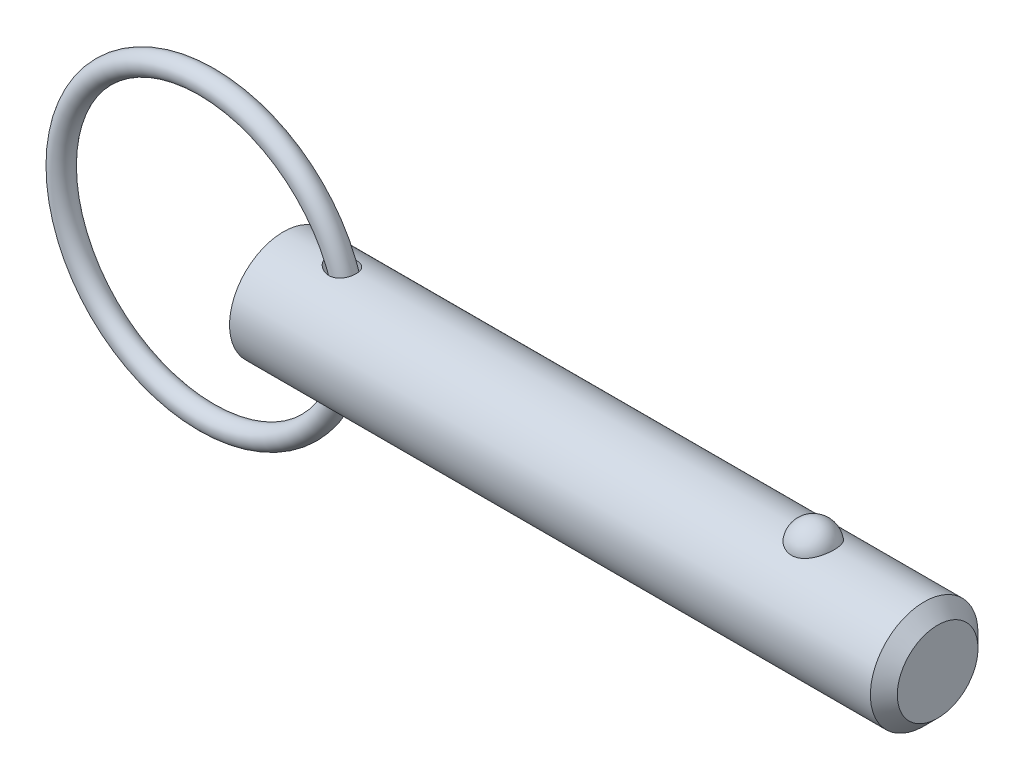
ISO-10303-21;
HEADER;
FILE_DESCRIPTION(('STEP AP214'),'2;1');
FILE_NAME('part.step','',(''),(''),'','','');
FILE_SCHEMA(('AUTOMOTIVE_DESIGN { 1 0 10303 214 1 1 1 1 }'));
ENDSEC;
DATA;
#1=APPLICATION_CONTEXT('core data for automotive mechanical design processes');
#2=APPLICATION_PROTOCOL_DEFINITION('international standard','automotive_design',2000,#1);
#3=PRODUCT_CONTEXT('',#1,'mechanical');
#4=PRODUCT('Part','Part','',(#3));
#5=PRODUCT_RELATED_PRODUCT_CATEGORY('part','',(#4));
#6=PRODUCT_DEFINITION_FORMATION('','',#4);
#7=PRODUCT_DEFINITION_CONTEXT('part definition',#1,'design');
#8=PRODUCT_DEFINITION('design','',#6,#7);
#9=PRODUCT_DEFINITION_SHAPE('','',#8);
#10=(LENGTH_UNIT() NAMED_UNIT(*) SI_UNIT(.MILLI.,.METRE.));
#11=(NAMED_UNIT(*) PLANE_ANGLE_UNIT() SI_UNIT($,.RADIAN.));
#12=(NAMED_UNIT(*) SI_UNIT($,.STERADIAN.) SOLID_ANGLE_UNIT());
#13=UNCERTAINTY_MEASURE_WITH_UNIT(LENGTH_MEASURE(1.E-05),#10,'distance_accuracy_value','');
#14=(GEOMETRIC_REPRESENTATION_CONTEXT(3) GLOBAL_UNCERTAINTY_ASSIGNED_CONTEXT((#13)) GLOBAL_UNIT_ASSIGNED_CONTEXT((#10,
#11,#12)) REPRESENTATION_CONTEXT('',''));
#15=CARTESIAN_POINT('',(0.,0.,0.));
#16=DIRECTION('',(0.,0.,1.));
#17=DIRECTION('',(1.,0.,0.));
#18=AXIS2_PLACEMENT_3D('',#15,#16,#17);
#19=CARTESIAN_POINT('',(-6.70471658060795,0.,0.));
#20=DIRECTION('',(0.,0.,1.));
#21=DIRECTION('',(1.,0.,0.));
#22=AXIS2_PLACEMENT_3D('',#19,#20,#21);
#23=TOROIDAL_SURFACE('',#22,12.7,0.940000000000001);
#24=CARTESIAN_POINT('',(6.93528341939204,0.,0.));
#25=VERTEX_POINT('',#24);
#26=VERTEX_LOOP('',#25);
#27=FACE_BOUND('',#26,.T.);
#28=ADVANCED_FACE('P0_F12',(#27),#23,.T.);
#29=CLOSED_SHELL('',(#28));
#30=MANIFOLD_SOLID_BREP('P0_B1',#29);
#31=CARTESIAN_POINT('',(0.,0.,0.));
#32=DIRECTION('',(1.,0.,0.));
#33=DIRECTION('',(0.,0.,-1.));
#34=AXIS2_PLACEMENT_3D('',#31,#32,#33);
#35=CYLINDRICAL_SURFACE('',#34,4.7);
#36=CARTESIAN_POINT('',(4.16378072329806,4.63584137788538,-0.773934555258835));
#37=CARTESIAN_POINT('',(4.22041228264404,4.62659903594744,-0.829297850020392));
#38=CARTESIAN_POINT('',(4.28206987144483,4.61719767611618,-0.87952289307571));
#39=CARTESIAN_POINT('',(4.41303152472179,4.59925351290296,-0.968997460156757));
#40=CARTESIAN_POINT('',(4.4823442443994,4.59071170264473,-1.00823437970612));
#41=CARTESIAN_POINT('',(4.626507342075,4.5755493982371,-1.07495006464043));
#42=CARTESIAN_POINT('',(4.70135029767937,4.56892638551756,-1.10244426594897));
#43=CARTESIAN_POINT('',(4.85470490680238,4.55848940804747,-1.14483874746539));
#44=CARTESIAN_POINT('',(4.93321503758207,4.55467428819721,-1.15974420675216));
#45=CARTESIAN_POINT('',(5.09197970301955,4.55051176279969,-1.17597559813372));
#46=CARTESIAN_POINT('',(5.17223836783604,4.55017372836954,-1.17726483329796));
#47=CARTESIAN_POINT('',(5.33159446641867,4.55326696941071,-1.16524823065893));
#48=CARTESIAN_POINT('',(5.41069268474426,4.55669556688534,-1.15195276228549));
#49=CARTESIAN_POINT('',(5.55698758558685,4.56647801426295,-1.11249214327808));
#50=CARTESIAN_POINT('',(5.62458628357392,4.57250771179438,-1.08773548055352));
#51=CARTESIAN_POINT('',(5.75397700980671,4.58665356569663,-1.02644632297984));
#52=CARTESIAN_POINT('',(5.8157717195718,4.59476875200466,-0.989919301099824));
#53=CARTESIAN_POINT('',(5.92681484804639,4.61135052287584,-0.90939126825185));
#54=CARTESIAN_POINT('',(5.97666790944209,4.61973919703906,-0.866204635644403));
#55=CARTESIAN_POINT('',(6.06817854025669,4.63643253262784,-0.771868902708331));
#56=CARTESIAN_POINT('',(6.10983710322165,4.64473720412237,-0.720720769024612));
#57=CARTESIAN_POINT('',(6.18318089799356,4.660174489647,-0.612928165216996));
#58=CARTESIAN_POINT('',(6.21503150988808,4.66732544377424,-0.55639864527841));
#59=CARTESIAN_POINT('',(6.26900210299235,4.67985590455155,-0.438689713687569));
#60=CARTESIAN_POINT('',(6.29112194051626,4.68523538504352,-0.377510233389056));
#61=CARTESIAN_POINT('',(6.32523846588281,4.6936733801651,-0.251831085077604));
#62=CARTESIAN_POINT('',(6.33717189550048,4.69671737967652,-0.187313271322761));
#63=CARTESIAN_POINT('',(6.35042407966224,4.70010386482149,-0.0571258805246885));
#64=CARTESIAN_POINT('',(6.3517424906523,4.70044626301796,0.00854373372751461));
#65=CARTESIAN_POINT('',(6.34371729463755,4.69838816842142,0.139481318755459));
#66=CARTESIAN_POINT('',(6.33432596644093,4.69597539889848,0.204746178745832));
#67=CARTESIAN_POINT('',(6.30500866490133,4.68864655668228,0.332720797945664));
#68=CARTESIAN_POINT('',(6.28508259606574,4.68373046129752,0.395430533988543));
#69=CARTESIAN_POINT('',(6.23516511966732,4.67193431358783,0.516455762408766));
#70=CARTESIAN_POINT('',(6.2051812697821,4.66505573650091,0.574774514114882));
#71=CARTESIAN_POINT('',(6.13586314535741,4.65009270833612,0.685387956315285));
#72=CARTESIAN_POINT('',(6.09652950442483,4.64200833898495,0.737683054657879));
#73=CARTESIAN_POINT('',(6.00979078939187,4.62559001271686,0.834455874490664));
#74=CARTESIAN_POINT('',(5.96243625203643,4.61725787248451,0.878979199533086));
#75=CARTESIAN_POINT('',(5.86079843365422,4.60122574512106,0.959378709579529));
#76=CARTESIAN_POINT('',(5.80651591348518,4.59352568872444,0.995255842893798));
#77=CARTESIAN_POINT('',(5.69277386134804,4.57961669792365,1.05741527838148));
#78=CARTESIAN_POINT('',(5.63333134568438,4.57340309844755,1.08372773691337));
#79=CARTESIAN_POINT('',(5.51084249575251,4.56305640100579,1.12650026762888));
#80=CARTESIAN_POINT('',(5.44779577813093,4.55892352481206,1.14295928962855));
#81=CARTESIAN_POINT('',(5.3179566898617,4.55299444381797,1.1663590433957));
#82=CARTESIAN_POINT('',(5.25110869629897,4.55127026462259,1.17300670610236));
#83=CARTESIAN_POINT('',(5.11716812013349,4.55043953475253,1.17622268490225));
#84=CARTESIAN_POINT('',(5.05007546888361,4.55133378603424,1.17278791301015));
#85=CARTESIAN_POINT('',(4.91166083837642,4.55569951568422,1.15571913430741));
#86=CARTESIAN_POINT('',(4.84044690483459,4.55937764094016,1.1412666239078));
#87=CARTESIAN_POINT('',(4.70108819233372,4.56903562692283,1.10196123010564));
#88=CARTESIAN_POINT('',(4.63294574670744,4.57501720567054,1.07710058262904));
#89=CARTESIAN_POINT('',(4.49477300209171,4.58927184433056,1.01474439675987));
#90=CARTESIAN_POINT('',(4.42520748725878,4.59771156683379,0.976252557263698));
#91=CARTESIAN_POINT('',(4.29354165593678,4.61552030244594,0.888246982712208));
#92=CARTESIAN_POINT('',(4.2314393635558,4.62488906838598,0.838736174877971));
#93=CARTESIAN_POINT('',(4.1260966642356,4.64192969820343,0.738015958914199));
#94=CARTESIAN_POINT('',(4.08142630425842,4.64963595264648,0.68830869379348));
#95=CARTESIAN_POINT('',(4.00081170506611,4.66411457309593,0.582144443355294));
#96=CARTESIAN_POINT('',(3.96485623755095,4.6708881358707,0.525696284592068));
#97=CARTESIAN_POINT('',(3.9081839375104,4.68183565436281,0.415917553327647));
#98=CARTESIAN_POINT('',(3.88599581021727,4.68624644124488,0.363372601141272));
#99=CARTESIAN_POINT('',(3.85055971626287,4.693376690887,0.255230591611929));
#100=CARTESIAN_POINT('',(3.83730635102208,4.69609717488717,0.199635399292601));
#101=CARTESIAN_POINT('',(3.82058225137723,4.69954043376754,0.0867104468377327));
#102=CARTESIAN_POINT('',(3.81714632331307,4.70025610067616,0.0293752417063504));
#103=CARTESIAN_POINT('',(3.82041409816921,4.69957935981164,-0.0849928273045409));
#104=CARTESIAN_POINT('',(3.82711802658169,4.69818690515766,-0.14202568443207));
#105=CARTESIAN_POINT('',(3.84950128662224,4.69360426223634,-0.250744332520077));
#106=CARTESIAN_POINT('',(3.8646389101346,4.69052274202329,-0.302548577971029));
#107=CARTESIAN_POINT('',(3.90261190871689,4.68295207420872,-0.403121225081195));
#108=CARTESIAN_POINT('',(3.92544863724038,4.67846267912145,-0.451889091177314));
#109=CARTESIAN_POINT('',(3.9799930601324,4.6680441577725,-0.549522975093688));
#110=CARTESIAN_POINT('',(4.01228648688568,4.66202553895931,-0.598050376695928));
#111=CARTESIAN_POINT('',(4.08340845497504,4.64931397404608,-0.689954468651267));
#112=CARTESIAN_POINT('',(4.1222426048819,4.64262045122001,-0.733326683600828));
#113=CARTESIAN_POINT('',(4.16378072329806,4.63584137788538,-0.773934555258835));
#114=B_SPLINE_CURVE_WITH_KNOTS('',3,(#36,#37,#38,#39,#40,#41,#42,#43,#44,#45,#46,#47,#48,#49,
#50,#51,#52,#53,#54,#55,#56,#57,#58,#59,#60,#61,#62,#63,#64,#65,#66,#67,#68,#69,#70,#71,#72,#73,
#74,#75,#76,#77,#78,#79,#80,#81,#82,#83,#84,#85,#86,#87,#88,#89,#90,#91,#92,#93,#94,#95,#96,#97,
#98,#99,#100,#101,#102,#103,#104,#105,#106,#107,#108,#109,#110,#111,#112,#113),.UNSPECIFIED.,
.T.,.F.,(4,2,2,2,2,2,2,2,2,2,2,2,2,2,2,2,2,2,2,2,2,2,2,2,2,2,2,2,2,2,2,2,2,2,2,2,2,2,4),(0.,
0.238977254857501,0.478227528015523,0.717162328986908,0.955998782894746,1.19547875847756,
1.43478857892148,1.65034375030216,1.8657988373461,2.06429861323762,2.26277430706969,
2.45769248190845,2.65261353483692,2.848736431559,3.04486567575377,3.24187227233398,
3.43888065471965,3.6357413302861,3.83258866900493,4.02823898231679,4.22386782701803,
4.41887441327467,4.61390177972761,4.81464443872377,5.0154485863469,5.2328283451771,
5.45037055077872,5.68914354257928,5.92785317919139,6.12887730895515,6.32964104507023,
6.50053592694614,6.67132745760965,6.84272375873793,7.0141238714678,7.17560768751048,
7.33711990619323,7.5122540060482,7.68753905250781),.UNSPECIFIED.);
#115=CARTESIAN_POINT('',(4.16378072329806,4.63584137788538,-0.773934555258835));
#116=VERTEX_POINT('',#115);
#117=EDGE_CURVE('P1_E40',#116,#116,#114,.T.);
#118=ORIENTED_EDGE('',*,*,#117,.T.);
#119=EDGE_LOOP('',(#118));
#120=FACE_BOUND('',#119,.T.);
#121=CARTESIAN_POINT('',(55.975,0.,0.));
#122=DIRECTION('',(1.,0.,0.));
#123=DIRECTION('',(0.,0.,-1.));
#124=AXIS2_PLACEMENT_3D('',#121,#122,#123);
#125=CIRCLE('',#124,4.7);
#126=CARTESIAN_POINT('',(55.975,0.,-4.7));
#127=VERTEX_POINT('',#126);
#128=EDGE_CURVE('P1_E25',#127,#127,#125,.T.);
#129=ORIENTED_EDGE('',*,*,#128,.F.);
#130=EDGE_LOOP('',(#129));
#131=FACE_BOUND('',#130,.T.);
#132=CARTESIAN_POINT('',(0.,0.,0.));
#133=DIRECTION('',(1.,0.,0.));
#134=DIRECTION('',(0.,0.,-1.));
#135=AXIS2_PLACEMENT_3D('',#132,#133,#134);
#136=CIRCLE('',#135,4.7);
#137=CARTESIAN_POINT('',(0.,0.,-4.7));
#138=VERTEX_POINT('',#137);
#139=EDGE_CURVE('P1_E9',#138,#138,#136,.T.);
#140=ORIENTED_EDGE('',*,*,#139,.T.);
#141=EDGE_LOOP('',(#140));
#142=FACE_BOUND('',#141,.T.);
#143=CARTESIAN_POINT('',(46.2806283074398,4.30387706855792,1.88855557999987));
#144=CARTESIAN_POINT('',(46.1828134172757,4.30388592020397,1.88854684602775));
#145=CARTESIAN_POINT('',(46.0848511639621,4.30731231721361,1.88078712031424));
#146=CARTESIAN_POINT('',(45.891662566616,4.32065009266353,1.84993192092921));
#147=CARTESIAN_POINT('',(45.7964438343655,4.33057798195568,1.82679740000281));
#148=CARTESIAN_POINT('',(45.6118175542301,4.3557457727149,1.76594245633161));
#149=CARTESIAN_POINT('',(45.5223953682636,4.37097162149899,1.7282605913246));
#150=CARTESIAN_POINT('',(45.3513907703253,4.4050778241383,1.6393730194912));
#151=CARTESIAN_POINT('',(45.269805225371,4.4239567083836,1.58817274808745));
#152=CARTESIAN_POINT('',(45.1139011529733,4.46404088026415,1.47181116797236));
#153=CARTESIAN_POINT('',(45.0398759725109,4.48529915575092,1.40627540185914));
#154=CARTESIAN_POINT('',(44.9035361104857,4.527485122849,1.2638780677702));
#155=CARTESIAN_POINT('',(44.8412249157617,4.54841271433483,1.18701313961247));
#156=CARTESIAN_POINT('',(44.7270723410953,4.58876216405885,1.02025841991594));
#157=CARTESIAN_POINT('',(44.6758113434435,4.60807744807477,0.929944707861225));
#158=CARTESIAN_POINT('',(44.5884245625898,4.6421320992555,0.741468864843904));
#159=CARTESIAN_POINT('',(44.5522995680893,4.65687122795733,0.643306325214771));
#160=CARTESIAN_POINT('',(44.4956718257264,4.68038485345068,0.440967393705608));
#161=CARTESIAN_POINT('',(44.4753048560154,4.68910744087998,0.336746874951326));
#162=CARTESIAN_POINT('',(44.4511323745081,4.69949255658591,0.126059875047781));
#163=CARTESIAN_POINT('',(44.4473260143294,4.70115544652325,0.0195935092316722));
#164=CARTESIAN_POINT('',(44.4563081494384,4.69727256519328,-0.191500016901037));
#165=CARTESIAN_POINT('',(44.4689415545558,4.69179416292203,-0.296135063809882));
#166=CARTESIAN_POINT('',(44.5102760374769,4.67429351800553,-0.501612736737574));
#167=CARTESIAN_POINT('',(44.5389773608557,4.66227117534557,-0.602455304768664));
#168=CARTESIAN_POINT('',(44.6119285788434,4.63286427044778,-0.797707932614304));
#169=CARTESIAN_POINT('',(44.6562044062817,4.61547077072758,-0.892106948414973));
#170=CARTESIAN_POINT('',(44.7594074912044,4.57709900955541,-1.07173134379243));
#171=CARTESIAN_POINT('',(44.8183362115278,4.55612039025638,-1.15695580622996));
#172=CARTESIAN_POINT('',(44.9502161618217,4.51257918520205,-1.31664252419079));
#173=CARTESIAN_POINT('',(45.0232867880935,4.49000423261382,-1.39100294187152));
#174=CARTESIAN_POINT('',(45.1814784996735,4.44594443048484,-1.52598548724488));
#175=CARTESIAN_POINT('',(45.2665990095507,4.42445952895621,-1.58660827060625));
#176=CARTESIAN_POINT('',(45.4452673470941,4.38543655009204,-1.69145998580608));
#177=CARTESIAN_POINT('',(45.5386518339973,4.36783887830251,-1.73594433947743));
#178=CARTESIAN_POINT('',(45.7324220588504,4.3382941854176,-1.80852276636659));
#179=CARTESIAN_POINT('',(45.8328051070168,4.32634500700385,-1.83662309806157));
#180=CARTESIAN_POINT('',(46.0322875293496,4.31005085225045,-1.87453136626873));
#181=CARTESIAN_POINT('',(46.1311967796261,4.30535309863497,-1.88518956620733));
#182=CARTESIAN_POINT('',(46.3295210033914,4.30299844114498,-1.89055986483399));
#183=CARTESIAN_POINT('',(46.4289358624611,4.30534000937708,-1.88527542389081));
#184=CARTESIAN_POINT('',(46.6218638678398,4.31657737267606,-1.85939299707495));
#185=CARTESIAN_POINT('',(46.7154624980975,4.32524571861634,-1.83932621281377));
#186=CARTESIAN_POINT('',(46.8977839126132,4.34791518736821,-1.7850744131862));
#187=CARTESIAN_POINT('',(46.9865063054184,4.36191673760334,-1.75088826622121));
#188=CARTESIAN_POINT('',(47.158694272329,4.39411605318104,-1.66845234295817));
#189=CARTESIAN_POINT('',(47.2420089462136,4.41239631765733,-1.61992036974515));
#190=CARTESIAN_POINT('',(47.399399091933,4.45109244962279,-1.51034589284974));
#191=CARTESIAN_POINT('',(47.4734723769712,4.47150882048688,-1.44930043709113));
#192=CARTESIAN_POINT('',(47.6144058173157,4.51353865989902,-1.31275193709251));
#193=CARTESIAN_POINT('',(47.6807014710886,4.53515983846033,-1.23666813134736));
#194=CARTESIAN_POINT('',(47.8000698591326,4.57635116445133,-1.07425533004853));
#195=CARTESIAN_POINT('',(47.8531402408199,4.59592094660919,-0.987924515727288));
#196=CARTESIAN_POINT('',(47.9464438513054,4.63161819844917,-0.804428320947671));
#197=CARTESIAN_POINT('',(47.9862298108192,4.64762063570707,-0.707010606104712));
#198=CARTESIAN_POINT('',(48.0498257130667,4.67374032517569,-0.50634418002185));
#199=CARTESIAN_POINT('',(48.0736358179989,4.68385763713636,-0.403095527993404));
#200=CARTESIAN_POINT('',(48.1047510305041,4.69716075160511,-0.193975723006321));
#201=CARTESIAN_POINT('',(48.1120987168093,4.70036443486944,-0.0881120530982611));
#202=CARTESIAN_POINT('',(48.1102611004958,4.6995691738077,0.123441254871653));
#203=CARTESIAN_POINT('',(48.1010764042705,4.69557049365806,0.229130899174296));
#204=CARTESIAN_POINT('',(48.0664922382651,4.68082941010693,0.436545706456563));
#205=CARTESIAN_POINT('',(48.041209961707,4.67013575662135,0.538293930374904));
#206=CARTESIAN_POINT('',(47.975050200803,4.64311776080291,0.73579747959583));
#207=CARTESIAN_POINT('',(47.934171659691,4.62679303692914,0.831552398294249));
#208=CARTESIAN_POINT('',(47.8372869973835,4.59002712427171,1.01512750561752));
#209=CARTESIAN_POINT('',(47.7811735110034,4.56955699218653,1.10288523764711));
#210=CARTESIAN_POINT('',(47.6551085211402,4.52671789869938,1.26730106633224));
#211=CARTESIAN_POINT('',(47.5851572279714,4.50434896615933,1.34395933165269));
#212=CARTESIAN_POINT('',(47.4327247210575,4.46008413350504,1.48428028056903));
#213=CARTESIAN_POINT('',(47.3502095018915,4.43818970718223,1.54790656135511));
#214=CARTESIAN_POINT('',(47.1747358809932,4.39746476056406,1.66008504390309));
#215=CARTESIAN_POINT('',(47.0817736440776,4.37863537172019,1.70863168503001));
#216=CARTESIAN_POINT('',(46.8910997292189,4.34688784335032,1.78783023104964));
#217=CARTESIAN_POINT('',(46.7936298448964,4.33380220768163,1.81899757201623));
#218=CARTESIAN_POINT('',(46.5944052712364,4.31435159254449,1.86467392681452));
#219=CARTESIAN_POINT('',(46.492663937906,4.30796708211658,1.87923136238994));
#220=CARTESIAN_POINT('',(46.3539136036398,4.3043503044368,1.8874737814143));
#221=CARTESIAN_POINT('',(46.3172813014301,4.30387375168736,1.8885588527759));
#222=CARTESIAN_POINT('',(46.2806283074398,4.30387706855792,1.88855557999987));
#223=B_SPLINE_CURVE_WITH_KNOTS('',3,(#143,#144,#145,#146,#147,#148,#149,#150,#151,#152,#153,
#154,#155,#156,#157,#158,#159,#160,#161,#162,#163,#164,#165,#166,#167,#168,#169,#170,#171,#172,
#173,#174,#175,#176,#177,#178,#179,#180,#181,#182,#183,#184,#185,#186,#187,#188,#189,#190,#191,
#192,#193,#194,#195,#196,#197,#198,#199,#200,#201,#202,#203,#204,#205,#206,#207,#208,#209,#210,
#211,#212,#213,#214,#215,#216,#217,#218,#219,#220,#221,#222),.UNSPECIFIED.,.T.,.F.,(4,2,2,2,2,2,
2,2,2,2,2,2,2,2,2,2,2,2,2,2,2,2,2,2,2,2,2,2,2,2,2,2,2,2,2,2,2,2,2,4),(0.,0.293339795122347,
0.587427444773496,0.88074090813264,1.17393661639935,1.47597417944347,1.77810150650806,
2.0935049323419,2.40892479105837,2.72703308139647,3.0451250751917,3.36023788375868,
3.67535550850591,3.9910003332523,4.30667668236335,4.62514463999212,4.94359739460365,
5.25676407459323,5.56981105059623,5.8670864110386,6.16429725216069,6.4513188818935,
6.73836351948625,7.03148013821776,7.3246659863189,7.63288296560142,7.94115473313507,
8.25895074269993,8.57674352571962,8.89371340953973,9.21067166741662,9.52534839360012,
9.84004644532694,10.157022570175,10.4739938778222,10.7918388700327,11.1098009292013,
11.4177488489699,11.7247967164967,11.834716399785),.UNSPECIFIED.);
#224=CARTESIAN_POINT('',(46.2806283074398,4.30387706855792,1.88855557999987));
#225=VERTEX_POINT('',#224);
#226=EDGE_CURVE('P1_E34',#225,#225,#223,.T.);
#227=ORIENTED_EDGE('',*,*,#226,.T.);
#228=EDGE_LOOP('',(#227));
#229=FACE_BOUND('',#228,.T.);
#230=CARTESIAN_POINT('',(4.16378072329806,-4.63584137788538,-0.773934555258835));
#231=CARTESIAN_POINT('',(4.11797605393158,-4.64331682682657,-0.729154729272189));
#232=CARTESIAN_POINT('',(4.07545237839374,-4.65068929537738,-0.681007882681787));
#233=CARTESIAN_POINT('',(3.99850919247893,-4.66454993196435,-0.578483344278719));
#234=CARTESIAN_POINT('',(3.9640846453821,-4.67103864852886,-0.524109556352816));
#235=CARTESIAN_POINT('',(3.90486465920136,-4.68247538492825,-0.409579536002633));
#236=CARTESIAN_POINT('',(3.88014787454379,-4.68741075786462,-0.349380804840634));
#237=CARTESIAN_POINT('',(3.84254060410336,-4.69500854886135,-0.225256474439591));
#238=CARTESIAN_POINT('',(3.8296375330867,-4.69767338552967,-0.161334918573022));
#239=CARTESIAN_POINT('',(3.81750619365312,-4.70018000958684,-0.0396774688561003));
#240=CARTESIAN_POINT('',(3.81686237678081,-4.70031401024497,0.0179134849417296));
#241=CARTESIAN_POINT('',(3.82570055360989,-4.69848615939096,0.132270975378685));
#242=CARTESIAN_POINT('',(3.83518142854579,-4.6965245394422,0.189037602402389));
#243=CARTESIAN_POINT('',(3.8627670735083,-4.69091189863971,0.296808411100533));
#244=CARTESIAN_POINT('',(3.88034293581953,-4.68736483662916,0.347956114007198));
#245=CARTESIAN_POINT('',(3.9229321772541,-4.67896699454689,0.446919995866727));
#246=CARTESIAN_POINT('',(3.94794743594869,-4.67411588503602,0.494735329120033));
#247=CARTESIAN_POINT('',(4.00723361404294,-4.66297432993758,0.590975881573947));
#248=CARTESIAN_POINT('',(4.0421878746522,-4.65658759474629,0.63896688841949));
#249=CARTESIAN_POINT('',(4.11850165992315,-4.64327412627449,0.729452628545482));
#250=CARTESIAN_POINT('',(4.15986486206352,-4.63634708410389,0.771944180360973));
#251=CARTESIAN_POINT('',(4.25563139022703,-4.62124878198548,0.858077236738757));
#252=CARTESIAN_POINT('',(4.31104724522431,-4.61307408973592,0.900593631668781));
#253=CARTESIAN_POINT('',(4.42760239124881,-4.59748077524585,0.977085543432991));
#254=CARTESIAN_POINT('',(4.48874590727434,-4.59006271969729,1.01105468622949));
#255=CARTESIAN_POINT('',(4.62409915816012,-4.5757760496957,1.07399161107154));
#256=CARTESIAN_POINT('',(4.69895162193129,-4.56912175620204,1.10163764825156));
#257=CARTESIAN_POINT('',(4.8523861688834,-4.55861611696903,1.14433682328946));
#258=CARTESIAN_POINT('',(4.93096882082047,-4.55476520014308,1.15938803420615));
#259=CARTESIAN_POINT('',(5.0898384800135,-4.55053674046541,1.17587995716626));
#260=CARTESIAN_POINT('',(5.17012835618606,-4.55016559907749,1.17729558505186));
#261=CARTESIAN_POINT('',(5.329560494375,-4.55319561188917,1.16552635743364));
#262=CARTESIAN_POINT('',(5.40870366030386,-4.55659361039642,1.15235371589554));
#263=CARTESIAN_POINT('',(5.55512154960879,-4.56632591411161,1.11311448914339));
#264=CARTESIAN_POINT('',(5.62279525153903,-4.57233592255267,1.08845479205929));
#265=CARTESIAN_POINT('',(5.75235194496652,-4.58645252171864,1.02734156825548));
#266=CARTESIAN_POINT('',(5.81423750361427,-4.59455817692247,0.990893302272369));
#267=CARTESIAN_POINT('',(5.92544729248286,-4.61112960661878,0.910507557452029));
#268=CARTESIAN_POINT('',(5.97537756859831,-4.61951638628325,0.867388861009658));
#269=CARTESIAN_POINT('',(6.067050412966,-4.63621447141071,0.773173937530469));
#270=CARTESIAN_POINT('',(6.1087939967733,-4.64452578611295,0.722078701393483));
#271=CARTESIAN_POINT('',(6.18230323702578,-4.65998194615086,0.614385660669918));
#272=CARTESIAN_POINT('',(6.21423602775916,-4.66714520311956,0.557904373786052));
#273=CARTESIAN_POINT('',(6.26837651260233,-4.67970630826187,0.440277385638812));
#274=CARTESIAN_POINT('',(6.29058407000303,-4.68510413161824,0.379131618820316));
#275=CARTESIAN_POINT('',(6.32487950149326,-4.69358284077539,0.253506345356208));
#276=CARTESIAN_POINT('',(6.33690441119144,-4.69664929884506,0.189008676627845));
#277=CARTESIAN_POINT('',(6.3503414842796,-4.70008248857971,0.05884554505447));
#278=CARTESIAN_POINT('',(6.35175330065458,-4.70044913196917,-0.00681995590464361));
#279=CARTESIAN_POINT('',(6.34391515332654,-4.69843881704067,-0.137767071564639));
#280=CARTESIAN_POINT('',(6.33461722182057,-4.69604951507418,-0.203045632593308));
#281=CARTESIAN_POINT('',(6.30548404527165,-4.68876413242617,-0.331063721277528));
#282=CARTESIAN_POINT('',(6.2856487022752,-4.68386802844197,-0.393803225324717));
#283=CARTESIAN_POINT('',(6.23590713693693,-4.67210599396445,-0.514904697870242));
#284=CARTESIAN_POINT('',(6.20600824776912,-4.66524149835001,-0.573269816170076));
#285=CARTESIAN_POINT('',(6.13685224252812,-4.65029918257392,-0.683989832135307));
#286=CARTESIAN_POINT('',(6.09759575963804,-4.6422214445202,-0.736345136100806));
#287=CARTESIAN_POINT('',(6.01099960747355,-4.62580793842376,-0.833250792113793));
#288=CARTESIAN_POINT('',(5.963710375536,-4.61747403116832,-0.877846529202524));
#289=CARTESIAN_POINT('',(5.86219002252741,-4.60143050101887,-0.958399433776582));
#290=CARTESIAN_POINT('',(5.80795966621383,-4.59372080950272,-0.99435755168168));
#291=CARTESIAN_POINT('',(5.69431062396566,-4.57978661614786,-1.05668157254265));
#292=CARTESIAN_POINT('',(5.63490936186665,-4.57355737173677,-1.08307825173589));
#293=CARTESIAN_POINT('',(5.51248756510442,-4.56317492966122,-1.12602176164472));
#294=CARTESIAN_POINT('',(5.44946662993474,-4.55902196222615,-1.1425675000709));
#295=CARTESIAN_POINT('',(5.3196775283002,-4.55305083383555,-1.16613984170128));
#296=CARTESIAN_POINT('',(5.25285368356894,-4.55130415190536,-1.17287534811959));
#297=CARTESIAN_POINT('',(5.11894995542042,-4.55042807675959,-1.17626714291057));
#298=CARTESIAN_POINT('',(5.05187000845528,-4.55129938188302,-1.17292074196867));
#299=CARTESIAN_POINT('',(4.91348721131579,-4.55561850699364,-1.15603764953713));
#300=CARTESIAN_POINT('',(4.84229084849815,-4.55927235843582,-1.14168541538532));
#301=CARTESIAN_POINT('',(4.70293860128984,-4.56888540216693,-1.10258192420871));
#302=CARTESIAN_POINT('',(4.63478566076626,-4.57484677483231,-1.07782082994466));
#303=CARTESIAN_POINT('',(4.49401200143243,-4.58932889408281,-1.01452290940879));
#304=CARTESIAN_POINT('',(4.42204931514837,-4.59808779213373,-0.974568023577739));
#305=CARTESIAN_POINT('',(4.28620227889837,-4.61656806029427,-0.882881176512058));
#306=CARTESIAN_POINT('',(4.22231268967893,-4.62628879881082,-0.831156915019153));
#307=CARTESIAN_POINT('',(4.16378072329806,-4.63584137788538,-0.773934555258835));
#308=B_SPLINE_CURVE_WITH_KNOTS('',3,(#230,#231,#232,#233,#234,#235,#236,#237,#238,#239,#240,
#241,#242,#243,#244,#245,#246,#247,#248,#249,#250,#251,#252,#253,#254,#255,#256,#257,#258,#259,
#260,#261,#262,#263,#264,#265,#266,#267,#268,#269,#270,#271,#272,#273,#274,#275,#276,#277,#278,
#279,#280,#281,#282,#283,#284,#285,#286,#287,#288,#289,#290,#291,#292,#293,#294,#295,#296,#297,
#298,#299,#300,#301,#302,#303,#304,#305,#306,#307),.UNSPECIFIED.,.T.,.F.,(4,2,2,2,2,2,2,2,2,2,2,
2,2,2,2,2,2,2,2,2,2,2,2,2,2,2,2,2,2,2,2,2,2,2,2,2,2,2,4),(0.,0.193263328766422,
0.386406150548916,0.581083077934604,0.775552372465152,0.947410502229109,1.11924964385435,
1.28117818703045,1.44314767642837,1.62161944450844,1.80019400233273,2.01034324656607,
2.22064874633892,2.45975127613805,2.69889038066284,2.93846932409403,3.1778478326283,
3.39350806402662,3.6090721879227,3.8076122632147,4.00612769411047,4.20104508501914,
4.39596521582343,4.59208201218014,4.78820522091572,4.98521027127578,5.18221715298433,
5.37908078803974,5.57593110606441,5.7715882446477,5.96722384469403,6.1622240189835,
6.35724581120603,6.55794420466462,6.75869613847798,6.97596054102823,7.1934307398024,
7.44055547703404,7.68751900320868),.UNSPECIFIED.);
#309=CARTESIAN_POINT('',(4.16378072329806,-4.63584137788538,-0.773934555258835));
#310=VERTEX_POINT('',#309);
#311=EDGE_CURVE('P1_E17',#310,#310,#308,.T.);
#312=ORIENTED_EDGE('',*,*,#311,.T.);
#313=EDGE_LOOP('',(#312));
#314=FACE_BOUND('',#313,.T.);
#315=ADVANCED_FACE('P1_F13',(#120,#131,#142,#229,#314),#35,.T.);
#316=CARTESIAN_POINT('',(0.,0.,0.));
#317=DIRECTION('',(-1.,0.,0.));
#318=DIRECTION('',(0.,0.,1.));
#319=AXIS2_PLACEMENT_3D('',#316,#317,#318);
#320=PLANE('',#319);
#321=ORIENTED_EDGE('',*,*,#139,.F.);
#322=EDGE_LOOP('',(#321));
#323=FACE_BOUND('',#322,.T.);
#324=ADVANCED_FACE('P1_F15',(#323),#320,.T.);
#325=CARTESIAN_POINT('',(57.15,0.,0.));
#326=DIRECTION('',(-1.,0.,0.));
#327=DIRECTION('',(0.,0.,1.));
#328=AXIS2_PLACEMENT_3D('',#325,#326,#327);
#329=CONICAL_SURFACE('',#328,3.52500000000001,0.785398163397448);
#330=ORIENTED_EDGE('',*,*,#128,.T.);
#331=EDGE_LOOP('',(#330));
#332=FACE_BOUND('',#331,.T.);
#333=CARTESIAN_POINT('',(57.15,0.,0.));
#334=DIRECTION('',(1.,0.,0.));
#335=DIRECTION('',(0.,0.,-1.));
#336=AXIS2_PLACEMENT_3D('',#333,#334,#335);
#337=CIRCLE('',#336,3.52500000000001);
#338=CARTESIAN_POINT('',(57.15,0.,-3.52500000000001));
#339=VERTEX_POINT('',#338);
#340=EDGE_CURVE('P1_E30',#339,#339,#337,.T.);
#341=ORIENTED_EDGE('',*,*,#340,.F.);
#342=EDGE_LOOP('',(#341));
#343=FACE_BOUND('',#342,.T.);
#344=ADVANCED_FACE('P1_F55',(#332,#343),#329,.T.);
#345=CARTESIAN_POINT('',(57.15,3.52500000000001,0.));
#346=DIRECTION('',(1.,0.,0.));
#347=DIRECTION('',(0.,0.,-1.));
#348=AXIS2_PLACEMENT_3D('',#345,#346,#347);
#349=PLANE('',#348);
#350=ORIENTED_EDGE('',*,*,#340,.T.);
#351=EDGE_LOOP('',(#350));
#352=FACE_BOUND('',#351,.T.);
#353=ADVANCED_FACE('P1_F51',(#352),#349,.T.);
#354=CARTESIAN_POINT('',(46.2806283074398,4.23,0.));
#355=DIRECTION('',(-1.,0.,0.));
#356=DIRECTION('',(0.,1.,0.));
#357=AXIS2_PLACEMENT_3D('',#354,#355,#356);
#358=SPHERICAL_SURFACE('',#357,1.89);
#359=ORIENTED_EDGE('',*,*,#226,.F.);
#360=EDGE_LOOP('',(#359));
#361=FACE_BOUND('',#360,.T.);
#362=ADVANCED_FACE('P1_F46',(#361),#358,.T.);
#363=CARTESIAN_POINT('',(-6.70471658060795,0.,0.));
#364=DIRECTION('',(0.,0.,1.));
#365=DIRECTION('',(1.,0.,0.));
#366=AXIS2_PLACEMENT_3D('',#363,#364,#365);
#367=TOROIDAL_SURFACE('',#366,12.7,1.175);
#368=ORIENTED_EDGE('',*,*,#311,.F.);
#369=EDGE_LOOP('',(#368));
#370=FACE_BOUND('',#369,.T.);
#371=ORIENTED_EDGE('',*,*,#117,.F.);
#372=EDGE_LOOP('',(#371));
#373=FACE_BOUND('',#372,.T.);
#374=ADVANCED_FACE('P1_F50',(#370,#373),#367,.F.);
#375=CLOSED_SHELL('',(#315,#324,#344,#353,#362,#374));
#376=MANIFOLD_SOLID_BREP('P1_B1',#375);
#377=ADVANCED_BREP_SHAPE_REPRESENTATION('',(#18,#30,#376),#14);
#378=SHAPE_DEFINITION_REPRESENTATION(#9,#377);
ENDSEC;
END-ISO-10303-21;
